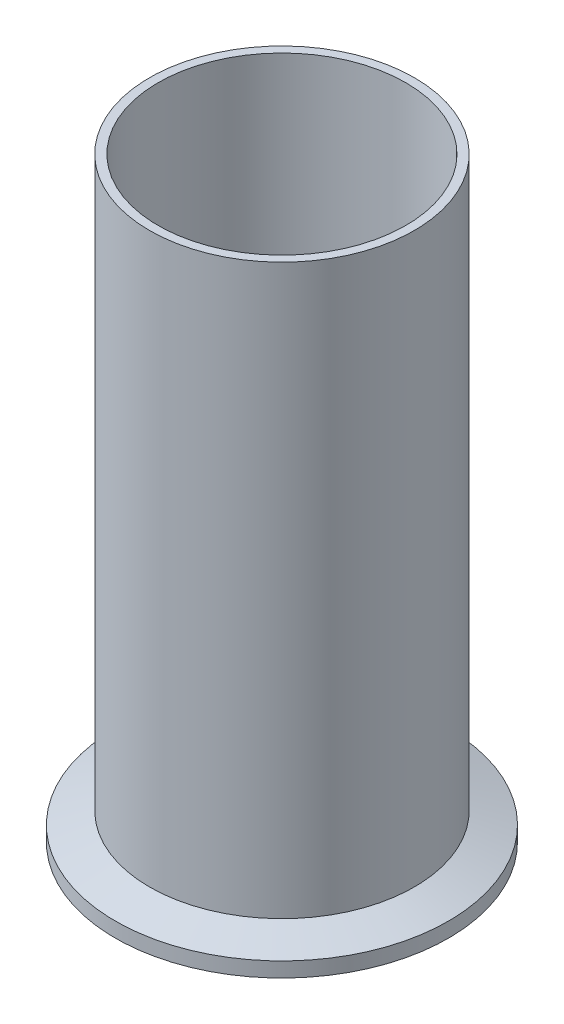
from build123d import *


with BuildPart() as part:
    # Sketch1 → Revolve2 (revolve)
    with BuildSketch(Plane.XY, mode=Mode.PRIVATE) as revolve2_sk:
        with BuildLine():
            Line((-23.749, 0), (-23.749, 114.3))
            Line((-23.749, 114.3), (-25.4, 114.3))
            Line((-25.4, 114.3), (-25.4, 5.229969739))
            Line((-25.4, 5.229969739), (-31.9532, 2.8448))
            Line((-31.9532, 2.8448), (-31.9532, 0))
            Line((-31.9532, 0), (-29.986608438, 0))
            ThreePointArc((-29.986608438, 0), (-29.554411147, 0.129217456), (-29.264066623, 0.474458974))
            ThreePointArc((-29.264066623, 0.474458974), (-28.1686, 1.1938), (-27.073133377, 0.474458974))
            ThreePointArc((-27.073133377, 0.474458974), (-26.782788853, 0.129217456), (-26.350591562, 0))
            Line((-26.350591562, 0), (-23.749, 0))
        make_face()
    revolve(revolve2_sk.sketch.rotate(Axis((0, 0, 0), (0, 1, 0)), 270), axis=Axis((0, 0, 0), (0, 1, 0)))


solid = part.part
